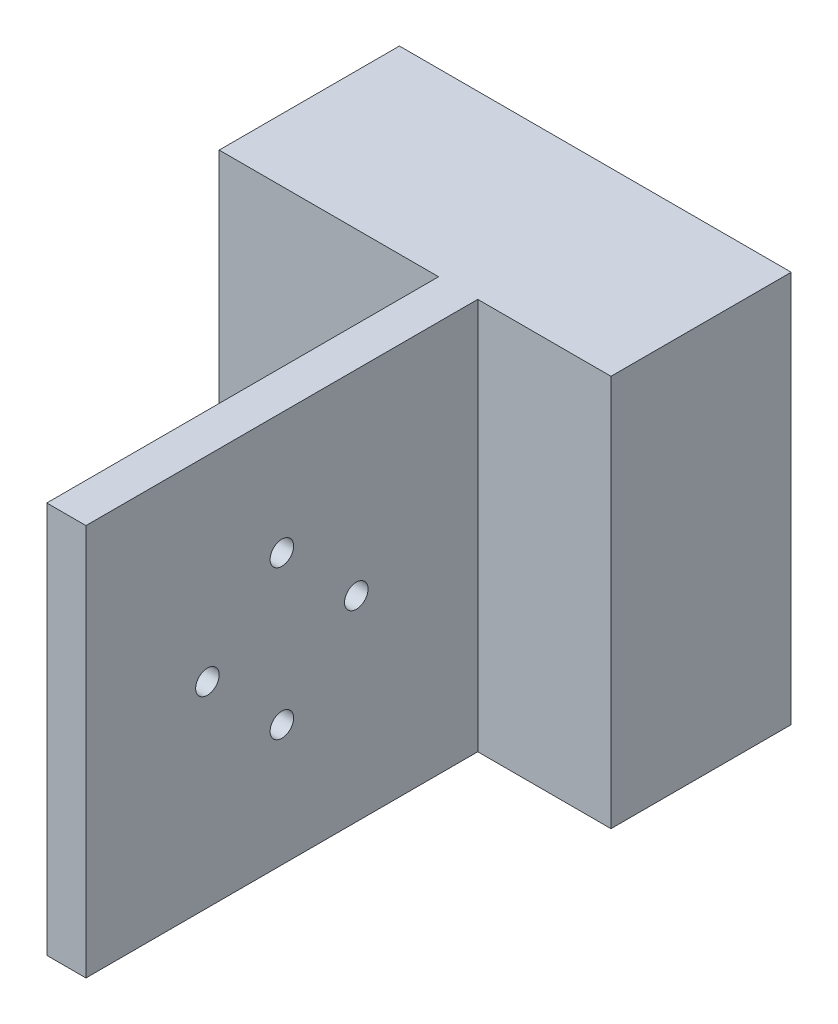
from build123d import *

# Parameters (mm, degrees)
SKETCH1_W           = 50
SKETCH1_H           = 50
SKETCH1_R           = 1.5
BOSS_EXTRUDE1_DEPTH = 5
SKETCH2_W           = 50
SKETCH2_H           = 50
BOSS_EXTRUDE2_DEPTH = 5
SKETCH3_W           = 50
SKETCH3_H           = 50
SKETCH3_R           = 6
BOSS_EXTRUDE3_DEPTH = 18


with BuildPart() as part:
    # Sketch1 → Boss-Extrude1 (new body)
    with BuildSketch(Plane(origin=(0, 0, 0), x_dir=(0, -1, 0), z_dir=(1, 0, 0))):
        Rectangle(SKETCH1_W, SKETCH1_H)
        with Locations(Location((0, 9.5, 0), (0, 0, 90))):
            Circle(SKETCH1_R, mode=Mode.SUBTRACT)
        with Locations(Location((9.5, 0, 0), (0, 0, 90))):
            Circle(SKETCH1_R, mode=Mode.SUBTRACT)
        with Locations(Location((0, -9.5, 0), (0, 0, 90))):
            Circle(SKETCH1_R, mode=Mode.SUBTRACT)
        with Locations(Location((-9.5, 0, 0), (0, 0, 90))):
            Circle(SKETCH1_R, mode=Mode.SUBTRACT)
    extrude(amount=BOSS_EXTRUDE1_DEPTH)

    # Sketch2 → Boss-Extrude2 (add)
    with BuildSketch(Plane(origin=(0, 0, -25), x_dir=(-1, 0, 0), z_dir=(0, 0, -1))):
        with Locations((3, 0)):
            Rectangle(SKETCH2_W, SKETCH2_H)
    extrude(amount=BOSS_EXTRUDE2_DEPTH)

    # Sketch3 → Boss-Extrude3 (add)
    with BuildSketch(Plane(origin=(0, 0, -30), x_dir=(-1, 0, 0), z_dir=(0, 0, -1))):
        with Locations((3, 0)):
            Rectangle(SKETCH3_W, SKETCH3_H)
        with Locations((3, 0)):
            Circle(SKETCH3_R, mode=Mode.SUBTRACT)
    extrude(amount=BOSS_EXTRUDE3_DEPTH)


solid = part.part
